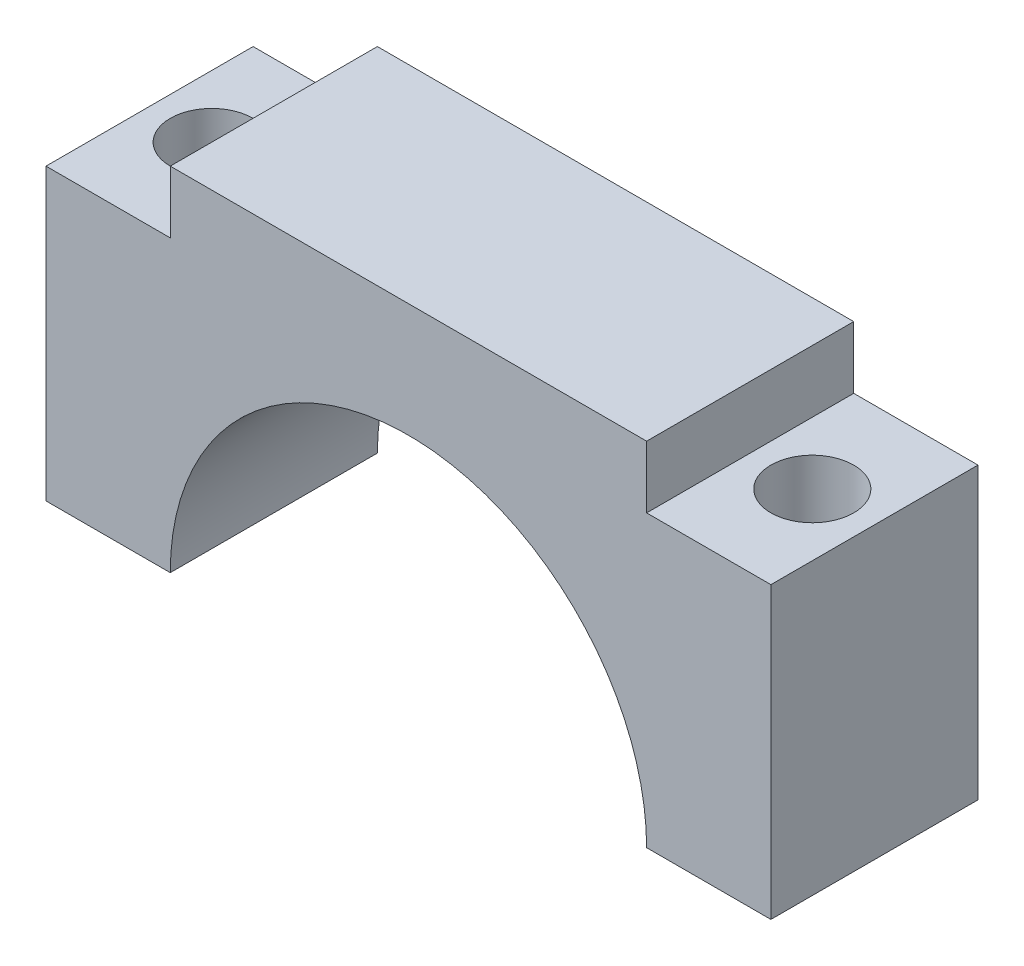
from build123d import *

# Parameters (mm, degrees)
ESQUISSE1_W             = 35
ESQUISSE1_H             = 17
BOSS_EXTRU_1_DEPTH      = 10
ENL_V_MAT_EXTRU_1_DEPTH = 10
ESQUISSE3_R             = 2
ENL_V_MAT_EXTRU_2_DEPTH = 45.851389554
ESQUISSE4_W             = 6
ESQUISSE4_H             = 10
ENL_V_MAT_EXTRU_3_DEPTH = 3


with BuildPart() as part:
    # Esquisse1 → Boss.-Extru.1 (new body)
    with BuildSketch(Plane.XY):
        with Locations((-22.782094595, 5.288461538)):
            Rectangle(ESQUISSE1_W, ESQUISSE1_H)
    extrude(amount=BOSS_EXTRU_1_DEPTH)

    # Esquisse2 → Enl_v. mat.-Extru.1 (cut)
    with BuildSketch(Plane.XY.offset(10)):
        with BuildLine():
            Line((-34.282094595, -3.211538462), (-11.282094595, -3.211538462))
            ThreePointArc((-11.282094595, -3.211538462), (-22.782094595, 8.288461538), (-34.282094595, -3.211538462))
        make_face()
    extrude(amount=-ENL_V_MAT_EXTRU_1_DEPTH, mode=Mode.SUBTRACT)

    # Esquisse3 → Enl_v. mat.-Extru.2 (cut, through all)
    with BuildSketch(Plane(origin=(0, -3.211538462, 0), x_dir=(-1, 0, 0), z_dir=(0, -1, 0))):
        with Locations(Location((8.282094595, -5, 0), (0, 0, 90))):
            Circle(ESQUISSE3_R)
        with Locations(Location((37.282094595, -5, 0), (0, 0, 90))):
            Circle(ESQUISSE3_R)
    extrude(amount=-ENL_V_MAT_EXTRU_2_DEPTH, mode=Mode.SUBTRACT)

    # Esquisse4 → Enl_v. mat.-Extru.3 (cut)
    with BuildSketch(Plane(origin=(0, 13.788461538, 0), x_dir=(1, 0, 0), z_dir=(0, 1, 0))):
        with Locations((-8.282094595, -5)):
            Rectangle(ESQUISSE4_W, ESQUISSE4_H)
        with Locations((-37.282094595, -5)):
            Rectangle(ESQUISSE4_W, ESQUISSE4_H)
    extrude(amount=-ENL_V_MAT_EXTRU_3_DEPTH, mode=Mode.SUBTRACT)


solid = part.part
